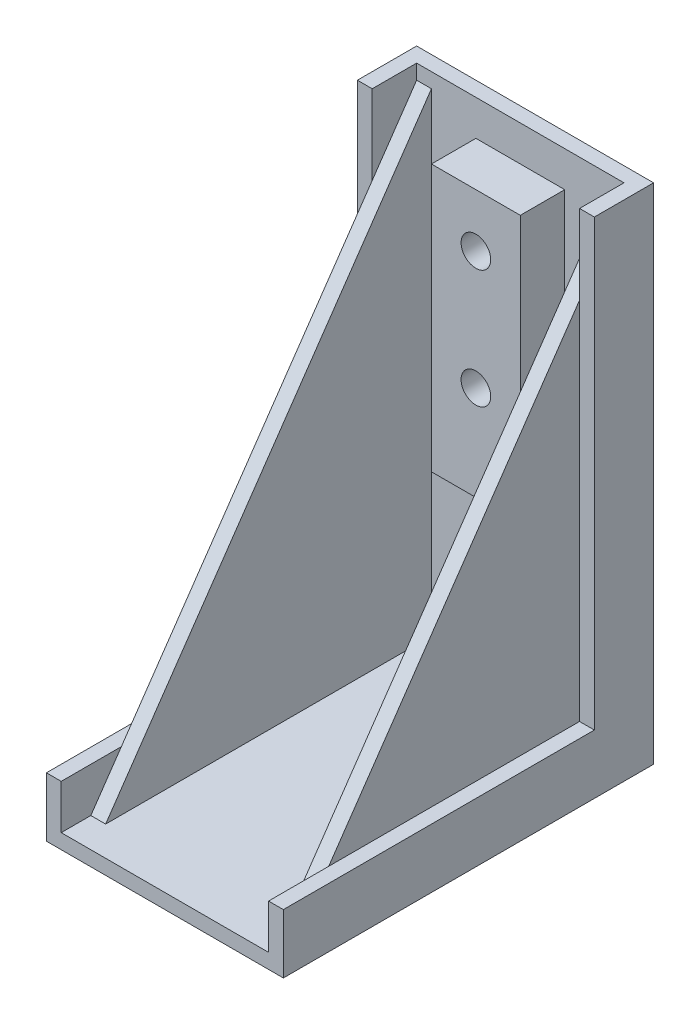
from build123d import *

# Parameters (mm, degrees)
BOSS_EXTRUDE1_DEPTH = 8.75
BOSS_EXTRUDE2_DEPTH = 1.25
BOSS_EXTRUDE3_DEPTH = 1.25
BOSS_EXTRUDE4_DEPTH = 1.25
BOSS_EXTRUDE5_DEPTH = 1.25
SKETCH6_W           = 7.5
SKETCH6_H           = 22.5
BOSS_EXTRUDE6_DEPTH = 3.75
SKETCH7_R           = 1.25
CUT_EXTRUDE1_DEPTH  = 50.906161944


with BuildPart() as part:
    # Sketch1 → Boss-Extrude1 (new, symmetric)
    with BuildSketch(Plane(origin=(0, 0, 0), x_dir=(0, 0, -1), z_dir=(1, 0, 0))):
        Polygon((0, 0), (-30, 0), (-30, -1.25), (1.25, -1.25), (1.25, 41.25), (0, 41.25), align=None)
    extrude(amount=BOSS_EXTRUDE1_DEPTH, both=True)

    # Sketch2 → Boss-Extrude2 (add)
    with BuildSketch(Plane(origin=(8.75, 0, 0), x_dir=(0, 0, -1), z_dir=(1, 0, 0))):
        Polygon((-30, -1.25), (1.25, -1.25), (1.25, 41.25), (-3.75, 41.25), (-3.75, 3.75), (-30, 3.75), align=None)
    extrude(amount=BOSS_EXTRUDE2_DEPTH)

    # Sketch3 → Boss-Extrude3 (add)
    with BuildSketch(Plane.ZY.offset(8.75)):
        Polygon((30, -1.25), (-1.25, -1.25), (-1.25, 41.25), (0, 41.25), (3.75, 41.25), (3.75, 3.75), (30, 3.75), (30, 0), align=None)
    extrude(amount=BOSS_EXTRUDE3_DEPTH)

    # Sketch4 → Boss-Extrude4 (add)
    with BuildSketch(Plane(origin=(-8.75, 0, 0), x_dir=(0, 0, -1), z_dir=(1, 0, 0))):
        Polygon((0, 0), (0, 40), (-27.5, 0), align=None)
    extrude(amount=BOSS_EXTRUDE4_DEPTH)

    # Sketch5 → Boss-Extrude5 (add)
    with BuildSketch(Plane.ZY.offset(-8.75)):
        Polygon((0, 0), (0, 40), (27.5, 0), align=None)
    extrude(amount=BOSS_EXTRUDE5_DEPTH)

    # Sketch6 → Boss-Extrude6 (add)
    with BuildSketch(Plane.XY):
        with Locations((0, 27)):
            Rectangle(SKETCH6_W, SKETCH6_H)
    extrude(amount=BOSS_EXTRUDE6_DEPTH)

    # Sketch7 → Cut-Extrude1 (cut, through all)
    with BuildSketch(Plane.XY.offset(3.75)):
        with Locations((0, 33.75)):
            Circle(SKETCH7_R)
        with Locations((0, 23.75)):
            Circle(SKETCH7_R)
    extrude(amount=-CUT_EXTRUDE1_DEPTH, mode=Mode.SUBTRACT)


solid = part.part
